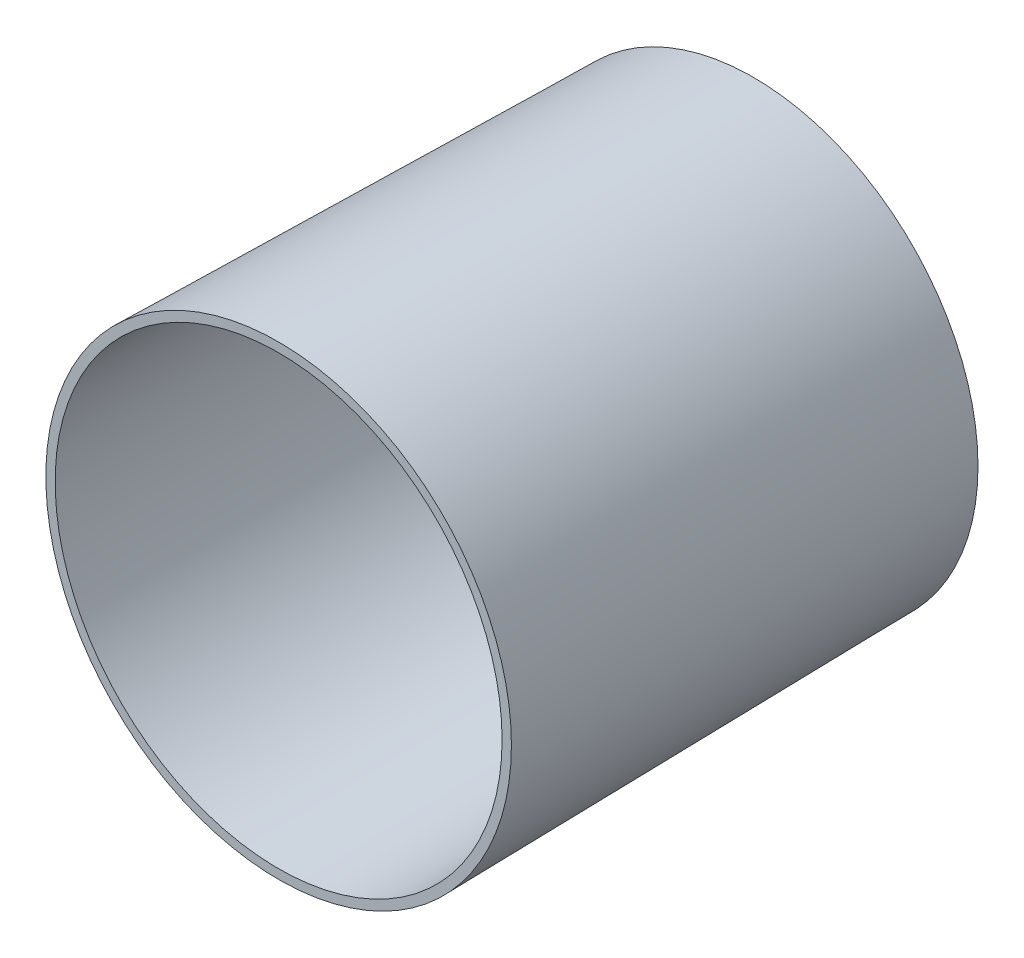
from build123d import *

# Parameters (mm, degrees)
VERRUNDUNG1_R = 1


with BuildPart() as part:
    # Skizze1 → Rotation1 (revolve)
    with BuildSketch(Plane(origin=(0, 0, 0), x_dir=(1, 0, 0), z_dir=(0, 1, 0))):
        Polygon((-55, -50), (-55.872753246, 0), (-55.890208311, 1), (-56.881480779, 1), (-56.881480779, 0), (-80, 0), (-80, -1), (-56.85545051, -1), (-56.000152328, -50), align=None)
    revolve(axis=Axis((-80, 0, 35.845585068), (0, 0, -1)))

    # Verrundung1
    verrundung1_edges = [part.edges().sort_by_distance(p)[0] for p in [
        (-103.14454949, 0, 1),
    ]]
    fillet(verrundung1_edges, radius=VERRUNDUNG1_R)


solid = part.part
